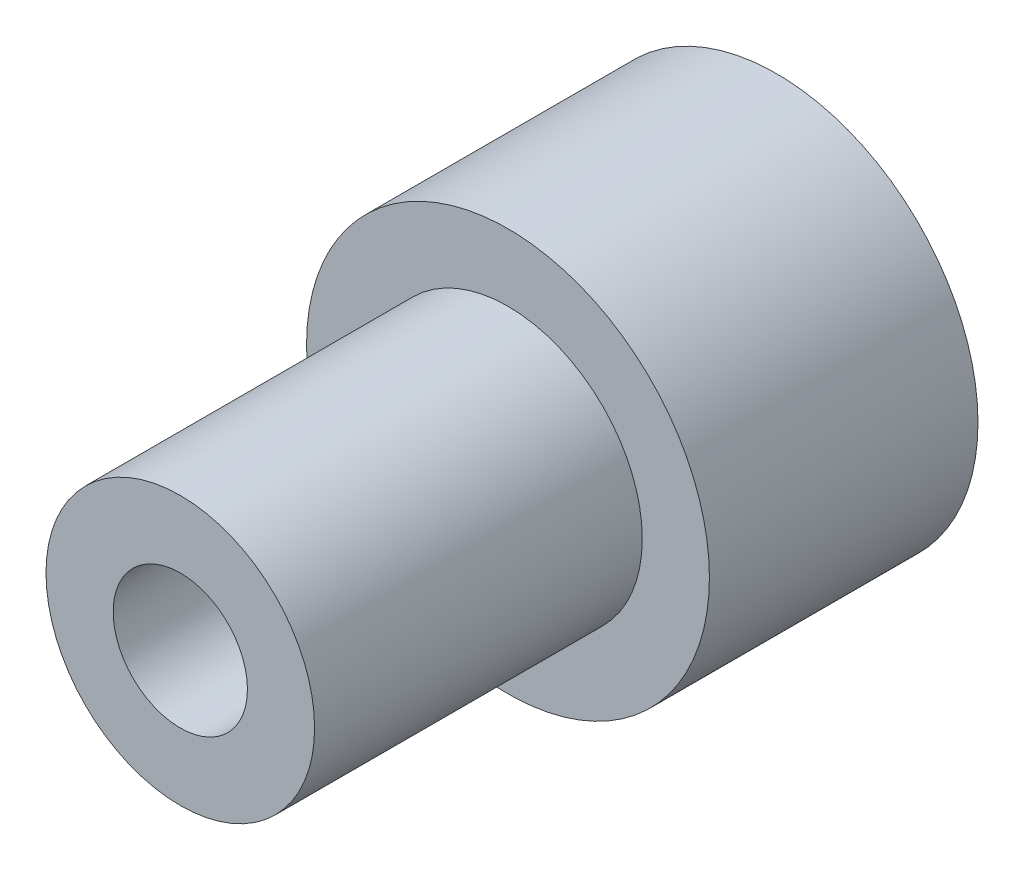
ISO-10303-21;
HEADER;
FILE_DESCRIPTION(('STEP AP214'),'2;1');
FILE_NAME('part.step','',(''),(''),'','','');
FILE_SCHEMA(('AUTOMOTIVE_DESIGN { 1 0 10303 214 1 1 1 1 }'));
ENDSEC;
DATA;
#1=APPLICATION_CONTEXT('core data for automotive mechanical design processes');
#2=APPLICATION_PROTOCOL_DEFINITION('international standard','automotive_design',2000,#1);
#3=PRODUCT_CONTEXT('',#1,'mechanical');
#4=PRODUCT('Part','Part','',(#3));
#5=PRODUCT_RELATED_PRODUCT_CATEGORY('part','',(#4));
#6=PRODUCT_DEFINITION_FORMATION('','',#4);
#7=PRODUCT_DEFINITION_CONTEXT('part definition',#1,'design');
#8=PRODUCT_DEFINITION('design','',#6,#7);
#9=PRODUCT_DEFINITION_SHAPE('','',#8);
#10=(LENGTH_UNIT() NAMED_UNIT(*) SI_UNIT(.MILLI.,.METRE.));
#11=(NAMED_UNIT(*) PLANE_ANGLE_UNIT() SI_UNIT($,.RADIAN.));
#12=(NAMED_UNIT(*) SI_UNIT($,.STERADIAN.) SOLID_ANGLE_UNIT());
#13=UNCERTAINTY_MEASURE_WITH_UNIT(LENGTH_MEASURE(1.E-05),#10,'distance_accuracy_value','');
#14=(GEOMETRIC_REPRESENTATION_CONTEXT(3) GLOBAL_UNCERTAINTY_ASSIGNED_CONTEXT((#13)) GLOBAL_UNIT_ASSIGNED_CONTEXT((#10,
#11,#12)) REPRESENTATION_CONTEXT('',''));
#15=CARTESIAN_POINT('',(0.,0.,0.));
#16=DIRECTION('',(0.,0.,1.));
#17=DIRECTION('',(1.,0.,0.));
#18=AXIS2_PLACEMENT_3D('',#15,#16,#17);
#19=CARTESIAN_POINT('',(0.,0.,0.));
#20=DIRECTION('',(0.,0.,1.));
#21=DIRECTION('',(1.,0.,0.));
#22=AXIS2_PLACEMENT_3D('',#19,#20,#21);
#23=CYLINDRICAL_SURFACE('',#22,1.5875);
#24=CARTESIAN_POINT('',(0.,0.,14.097));
#25=DIRECTION('',(0.,0.,1.));
#26=DIRECTION('',(1.,0.,0.));
#27=AXIS2_PLACEMENT_3D('',#24,#25,#26);
#28=CIRCLE('',#27,1.5875);
#29=CARTESIAN_POINT('',(1.5875,0.,14.097));
#30=VERTEX_POINT('',#29);
#31=EDGE_CURVE('E138',#30,#30,#28,.T.);
#32=ORIENTED_EDGE('',*,*,#31,.T.);
#33=EDGE_LOOP('',(#32));
#34=FACE_BOUND('',#33,.T.);
#35=CARTESIAN_POINT('',(0.,0.,3.683));
#36=DIRECTION('',(0.,0.,-1.));
#37=DIRECTION('',(-1.,0.,0.));
#38=AXIS2_PLACEMENT_3D('',#35,#36,#37);
#39=CIRCLE('',#38,1.5875);
#40=CARTESIAN_POINT('',(-1.5875,0.,3.683));
#41=VERTEX_POINT('',#40);
#42=EDGE_CURVE('E32',#41,#41,#39,.F.);
#43=ORIENTED_EDGE('',*,*,#42,.F.);
#44=EDGE_LOOP('',(#43));
#45=FACE_BOUND('',#44,.T.);
#46=ADVANCED_FACE('F28',(#34,#45),#23,.F.);
#47=CARTESIAN_POINT('',(0.,0.,6.35));
#48=DIRECTION('',(0.,0.,1.));
#49=DIRECTION('',(1.,0.,0.));
#50=AXIS2_PLACEMENT_3D('',#47,#48,#49);
#51=PLANE('',#50);
#52=CARTESIAN_POINT('',(0.,0.,6.35));
#53=DIRECTION('',(0.,0.,1.));
#54=DIRECTION('',(1.,0.,0.));
#55=AXIS2_PLACEMENT_3D('',#52,#53,#54);
#56=CIRCLE('',#55,4.7625);
#57=CARTESIAN_POINT('',(4.7625,0.,6.35));
#58=VERTEX_POINT('',#57);
#59=EDGE_CURVE('E11',#58,#58,#56,.T.);
#60=ORIENTED_EDGE('',*,*,#59,.T.);
#61=EDGE_LOOP('',(#60));
#62=FACE_BOUND('',#61,.T.);
#63=CARTESIAN_POINT('',(0.,0.,6.35));
#64=DIRECTION('',(0.,0.,1.));
#65=DIRECTION('',(1.,0.,0.));
#66=AXIS2_PLACEMENT_3D('',#63,#64,#65);
#67=CIRCLE('',#66,3.175);
#68=CARTESIAN_POINT('',(3.175,0.,6.35));
#69=VERTEX_POINT('',#68);
#70=EDGE_CURVE('E141',#69,#69,#67,.T.);
#71=ORIENTED_EDGE('',*,*,#70,.F.);
#72=EDGE_LOOP('',(#71));
#73=FACE_BOUND('',#72,.T.);
#74=ADVANCED_FACE('F160',(#62,#73),#51,.T.);
#75=CARTESIAN_POINT('',(0.,0.,6.35));
#76=DIRECTION('',(0.,0.,-1.));
#77=DIRECTION('',(-1.,0.,0.));
#78=AXIS2_PLACEMENT_3D('',#75,#76,#77);
#79=CYLINDRICAL_SURFACE('',#78,4.7625);
#80=ORIENTED_EDGE('',*,*,#59,.F.);
#81=EDGE_LOOP('',(#80));
#82=FACE_BOUND('',#81,.T.);
#83=CARTESIAN_POINT('',(0.,0.,0.));
#84=DIRECTION('',(0.,0.,1.));
#85=DIRECTION('',(1.,0.,0.));
#86=AXIS2_PLACEMENT_3D('',#83,#84,#85);
#87=CIRCLE('',#86,4.7625);
#88=CARTESIAN_POINT('',(4.7625,0.,0.));
#89=VERTEX_POINT('',#88);
#90=EDGE_CURVE('E37',#89,#89,#87,.T.);
#91=ORIENTED_EDGE('',*,*,#90,.T.);
#92=EDGE_LOOP('',(#91));
#93=FACE_BOUND('',#92,.T.);
#94=ADVANCED_FACE('F30',(#82,#93),#79,.T.);
#95=CARTESIAN_POINT('',(0.,0.,0.));
#96=DIRECTION('',(0.,0.,1.));
#97=DIRECTION('',(1.,0.,0.));
#98=AXIS2_PLACEMENT_3D('',#95,#96,#97);
#99=PLANE('',#98);
#100=DIRECTION('',(0.866025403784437,-0.500000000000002,0.));
#101=VECTOR('',#100,1.);
#102=CARTESIAN_POINT('',(2.38125,1.3748153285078,0.));
#103=LINE('',#102,#101);
#104=CARTESIAN_POINT('',(0.,2.74963065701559,0.));
#105=VERTEX_POINT('',#104);
#106=CARTESIAN_POINT('',(2.38125,1.3748153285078,0.));
#107=VERTEX_POINT('',#106);
#108=EDGE_CURVE('E98',#105,#107,#103,.T.);
#109=ORIENTED_EDGE('',*,*,#108,.F.);
#110=DIRECTION('',(0.86602540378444,0.499999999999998,0.));
#111=VECTOR('',#110,1.);
#112=CARTESIAN_POINT('',(-2.38125,1.3748153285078,0.));
#113=LINE('',#112,#111);
#114=CARTESIAN_POINT('',(-2.38125,1.3748153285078,0.));
#115=VERTEX_POINT('',#114);
#116=EDGE_CURVE('E44',#115,#105,#113,.T.);
#117=ORIENTED_EDGE('',*,*,#116,.F.);
#118=DIRECTION('',(0.,1.,0.));
#119=VECTOR('',#118,1.);
#120=CARTESIAN_POINT('',(-2.38125,1.3748153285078,0.));
#121=LINE('',#120,#119);
#122=CARTESIAN_POINT('',(-2.38125,-1.3748153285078,0.));
#123=VERTEX_POINT('',#122);
#124=EDGE_CURVE('E114',#123,#115,#121,.T.);
#125=ORIENTED_EDGE('',*,*,#124,.F.);
#126=DIRECTION('',(-0.866025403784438,0.5,0.));
#127=VECTOR('',#126,1.);
#128=CARTESIAN_POINT('',(0.,-2.74963065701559,0.));
#129=LINE('',#128,#127);
#130=CARTESIAN_POINT('',(0.,-2.74963065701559,0.));
#131=VERTEX_POINT('',#130);
#132=EDGE_CURVE('E108',#131,#123,#129,.T.);
#133=ORIENTED_EDGE('',*,*,#132,.F.);
#134=DIRECTION('',(-0.866025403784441,-0.499999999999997,0.));
#135=VECTOR('',#134,1.);
#136=CARTESIAN_POINT('',(2.38125,-1.3748153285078,0.));
#137=LINE('',#136,#135);
#138=CARTESIAN_POINT('',(2.38125,-1.3748153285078,0.));
#139=VERTEX_POINT('',#138);
#140=EDGE_CURVE('E106',#139,#131,#137,.T.);
#141=ORIENTED_EDGE('',*,*,#140,.F.);
#142=DIRECTION('',(0.,-1.,0.));
#143=VECTOR('',#142,1.);
#144=CARTESIAN_POINT('',(2.38125,1.3748153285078,0.));
#145=LINE('',#144,#143);
#146=EDGE_CURVE('E87',#107,#139,#145,.T.);
#147=ORIENTED_EDGE('',*,*,#146,.F.);
#148=EDGE_LOOP('',(#109,#117,#125,#133,#141,#147));
#149=FACE_BOUND('',#148,.T.);
#150=ORIENTED_EDGE('',*,*,#90,.F.);
#151=EDGE_LOOP('',(#150));
#152=FACE_BOUND('',#151,.T.);
#153=ADVANCED_FACE('F102',(#149,#152),#99,.F.);
#154=CARTESIAN_POINT('',(0.,0.,14.097));
#155=DIRECTION('',(0.,0.,-1.));
#156=DIRECTION('',(-1.,0.,0.));
#157=AXIS2_PLACEMENT_3D('',#154,#155,#156);
#158=CYLINDRICAL_SURFACE('',#157,3.175);
#159=CARTESIAN_POINT('',(0.,0.,14.097));
#160=DIRECTION('',(0.,0.,1.));
#161=DIRECTION('',(1.,0.,0.));
#162=AXIS2_PLACEMENT_3D('',#159,#160,#161);
#163=CIRCLE('',#162,3.175);
#164=CARTESIAN_POINT('',(3.175,0.,14.097));
#165=VERTEX_POINT('',#164);
#166=EDGE_CURVE('E144',#165,#165,#163,.T.);
#167=ORIENTED_EDGE('',*,*,#166,.F.);
#168=EDGE_LOOP('',(#167));
#169=FACE_BOUND('',#168,.T.);
#170=ORIENTED_EDGE('',*,*,#70,.T.);
#171=EDGE_LOOP('',(#170));
#172=FACE_BOUND('',#171,.T.);
#173=ADVANCED_FACE('F151',(#169,#172),#158,.T.);
#174=CARTESIAN_POINT('',(0.,0.,14.097));
#175=DIRECTION('',(0.,0.,1.));
#176=DIRECTION('',(1.,0.,0.));
#177=AXIS2_PLACEMENT_3D('',#174,#175,#176);
#178=PLANE('',#177);
#179=ORIENTED_EDGE('',*,*,#31,.F.);
#180=EDGE_LOOP('',(#179));
#181=FACE_BOUND('',#180,.T.);
#182=ORIENTED_EDGE('',*,*,#166,.T.);
#183=EDGE_LOOP('',(#182));
#184=FACE_BOUND('',#183,.T.);
#185=ADVANCED_FACE('F157',(#181,#184),#178,.T.);
#186=CARTESIAN_POINT('',(2.38125,4.12444598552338,3.683));
#187=DIRECTION('',(0.,0.,-1.));
#188=DIRECTION('',(-1.,0.,0.));
#189=AXIS2_PLACEMENT_3D('',#186,#187,#188);
#190=PLANE('',#189);
#191=DIRECTION('',(0.86602540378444,0.499999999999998,0.));
#192=VECTOR('',#191,1.);
#193=CARTESIAN_POINT('',(-2.38125,1.3748153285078,3.683));
#194=LINE('',#193,#192);
#195=CARTESIAN_POINT('',(-2.38125,1.3748153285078,3.683));
#196=VERTEX_POINT('',#195);
#197=CARTESIAN_POINT('',(0.,2.7496306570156,3.683));
#198=VERTEX_POINT('',#197);
#199=EDGE_CURVE('E116',#196,#198,#194,.T.);
#200=ORIENTED_EDGE('',*,*,#199,.T.);
#201=DIRECTION('',(0.866025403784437,-0.500000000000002,0.));
#202=VECTOR('',#201,1.);
#203=CARTESIAN_POINT('',(2.38125,1.3748153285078,3.683));
#204=LINE('',#203,#202);
#205=CARTESIAN_POINT('',(2.38125,1.3748153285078,3.683));
#206=VERTEX_POINT('',#205);
#207=EDGE_CURVE('E119',#198,#206,#204,.T.);
#208=ORIENTED_EDGE('',*,*,#207,.T.);
#209=DIRECTION('',(0.,-1.,0.));
#210=VECTOR('',#209,1.);
#211=CARTESIAN_POINT('',(2.38125,1.3748153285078,3.683));
#212=LINE('',#211,#210);
#213=CARTESIAN_POINT('',(2.38125,-1.3748153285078,3.683));
#214=VERTEX_POINT('',#213);
#215=EDGE_CURVE('E90',#206,#214,#212,.T.);
#216=ORIENTED_EDGE('',*,*,#215,.T.);
#217=DIRECTION('',(-0.866025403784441,-0.499999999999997,0.));
#218=VECTOR('',#217,1.);
#219=CARTESIAN_POINT('',(2.38125,-1.3748153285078,3.683));
#220=LINE('',#219,#218);
#221=CARTESIAN_POINT('',(0.,-2.74963065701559,3.683));
#222=VERTEX_POINT('',#221);
#223=EDGE_CURVE('E122',#214,#222,#220,.T.);
#224=ORIENTED_EDGE('',*,*,#223,.T.);
#225=DIRECTION('',(-0.866025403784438,0.5,0.));
#226=VECTOR('',#225,1.);
#227=CARTESIAN_POINT('',(0.,-2.74963065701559,3.683));
#228=LINE('',#227,#226);
#229=CARTESIAN_POINT('',(-2.38125,-1.3748153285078,3.683));
#230=VERTEX_POINT('',#229);
#231=EDGE_CURVE('E125',#222,#230,#228,.T.);
#232=ORIENTED_EDGE('',*,*,#231,.T.);
#233=DIRECTION('',(0.,1.,0.));
#234=VECTOR('',#233,1.);
#235=CARTESIAN_POINT('',(-2.38125,1.3748153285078,3.683));
#236=LINE('',#235,#234);
#237=EDGE_CURVE('E128',#230,#196,#236,.T.);
#238=ORIENTED_EDGE('',*,*,#237,.T.);
#239=EDGE_LOOP('',(#200,#208,#216,#224,#232,#238));
#240=FACE_BOUND('',#239,.T.);
#241=ORIENTED_EDGE('',*,*,#42,.T.);
#242=EDGE_LOOP('',(#241));
#243=FACE_BOUND('',#242,.T.);
#244=ADVANCED_FACE('F175',(#240,#243),#190,.T.);
#245=CARTESIAN_POINT('',(-2.38125,1.3748153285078,3.683));
#246=DIRECTION('',(-0.499999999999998,0.86602540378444,0.));
#247=DIRECTION('',(-0.86602540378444,-0.499999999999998,0.));
#248=AXIS2_PLACEMENT_3D('',#245,#246,#247);
#249=PLANE('',#248);
#250=ORIENTED_EDGE('',*,*,#116,.T.);
#251=DIRECTION('',(0.,0.,-1.));
#252=VECTOR('',#251,1.);
#253=CARTESIAN_POINT('',(0.,2.7496306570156,3.683));
#254=LINE('',#253,#252);
#255=EDGE_CURVE('E95',#198,#105,#254,.T.);
#256=ORIENTED_EDGE('',*,*,#255,.F.);
#257=ORIENTED_EDGE('',*,*,#199,.F.);
#258=DIRECTION('',(0.,0.,-1.));
#259=VECTOR('',#258,1.);
#260=CARTESIAN_POINT('',(-2.38125,1.3748153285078,3.683));
#261=LINE('',#260,#259);
#262=EDGE_CURVE('E51',#196,#115,#261,.T.);
#263=ORIENTED_EDGE('',*,*,#262,.T.);
#264=EDGE_LOOP('',(#250,#256,#257,#263));
#265=FACE_BOUND('',#264,.T.);
#266=ADVANCED_FACE('F172',(#265),#249,.F.);
#267=CARTESIAN_POINT('',(-2.38125,1.3748153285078,3.683));
#268=DIRECTION('',(-1.,0.,0.));
#269=DIRECTION('',(0.,-1.,0.));
#270=AXIS2_PLACEMENT_3D('',#267,#268,#269);
#271=PLANE('',#270);
#272=ORIENTED_EDGE('',*,*,#124,.T.);
#273=ORIENTED_EDGE('',*,*,#262,.F.);
#274=ORIENTED_EDGE('',*,*,#237,.F.);
#275=DIRECTION('',(0.,0.,-1.));
#276=VECTOR('',#275,1.);
#277=CARTESIAN_POINT('',(-2.38125,-1.3748153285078,3.683));
#278=LINE('',#277,#276);
#279=EDGE_CURVE('E132',#230,#123,#278,.T.);
#280=ORIENTED_EDGE('',*,*,#279,.T.);
#281=EDGE_LOOP('',(#272,#273,#274,#280));
#282=FACE_BOUND('',#281,.T.);
#283=ADVANCED_FACE('F191',(#282),#271,.F.);
#284=CARTESIAN_POINT('',(0.,-2.74963065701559,3.683));
#285=DIRECTION('',(-0.5,-0.866025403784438,0.));
#286=DIRECTION('',(0.866025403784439,-0.5,0.));
#287=AXIS2_PLACEMENT_3D('',#284,#285,#286);
#288=PLANE('',#287);
#289=ORIENTED_EDGE('',*,*,#132,.T.);
#290=ORIENTED_EDGE('',*,*,#279,.F.);
#291=ORIENTED_EDGE('',*,*,#231,.F.);
#292=DIRECTION('',(0.,0.,-1.));
#293=VECTOR('',#292,1.);
#294=CARTESIAN_POINT('',(0.,-2.74963065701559,3.683));
#295=LINE('',#294,#293);
#296=EDGE_CURVE('E134',#222,#131,#295,.T.);
#297=ORIENTED_EDGE('',*,*,#296,.T.);
#298=EDGE_LOOP('',(#289,#290,#291,#297));
#299=FACE_BOUND('',#298,.T.);
#300=ADVANCED_FACE('F196',(#299),#288,.F.);
#301=CARTESIAN_POINT('',(2.38125,-1.3748153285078,3.683));
#302=DIRECTION('',(0.499999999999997,-0.866025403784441,0.));
#303=DIRECTION('',(0.866025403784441,0.499999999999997,0.));
#304=AXIS2_PLACEMENT_3D('',#301,#302,#303);
#305=PLANE('',#304);
#306=ORIENTED_EDGE('',*,*,#140,.T.);
#307=ORIENTED_EDGE('',*,*,#296,.F.);
#308=ORIENTED_EDGE('',*,*,#223,.F.);
#309=DIRECTION('',(0.,0.,-1.));
#310=VECTOR('',#309,1.);
#311=CARTESIAN_POINT('',(2.38125,-1.3748153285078,3.683));
#312=LINE('',#311,#310);
#313=EDGE_CURVE('E94',#214,#139,#312,.T.);
#314=ORIENTED_EDGE('',*,*,#313,.T.);
#315=EDGE_LOOP('',(#306,#307,#308,#314));
#316=FACE_BOUND('',#315,.T.);
#317=ADVANCED_FACE('F199',(#316),#305,.F.);
#318=CARTESIAN_POINT('',(2.38125,1.3748153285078,3.683));
#319=DIRECTION('',(1.,0.,0.));
#320=DIRECTION('',(0.,1.,0.));
#321=AXIS2_PLACEMENT_3D('',#318,#319,#320);
#322=PLANE('',#321);
#323=ORIENTED_EDGE('',*,*,#146,.T.);
#324=ORIENTED_EDGE('',*,*,#313,.F.);
#325=ORIENTED_EDGE('',*,*,#215,.F.);
#326=DIRECTION('',(0.,0.,-1.));
#327=VECTOR('',#326,1.);
#328=CARTESIAN_POINT('',(2.38125,1.3748153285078,3.683));
#329=LINE('',#328,#327);
#330=EDGE_CURVE('E83',#206,#107,#329,.T.);
#331=ORIENTED_EDGE('',*,*,#330,.T.);
#332=EDGE_LOOP('',(#323,#324,#325,#331));
#333=FACE_BOUND('',#332,.T.);
#334=ADVANCED_FACE('F85',(#333),#322,.F.);
#335=CARTESIAN_POINT('',(2.38125,1.3748153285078,3.683));
#336=DIRECTION('',(0.500000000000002,0.866025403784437,0.));
#337=DIRECTION('',(-0.866025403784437,0.500000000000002,0.));
#338=AXIS2_PLACEMENT_3D('',#335,#336,#337);
#339=PLANE('',#338);
#340=ORIENTED_EDGE('',*,*,#108,.T.);
#341=ORIENTED_EDGE('',*,*,#330,.F.);
#342=ORIENTED_EDGE('',*,*,#207,.F.);
#343=ORIENTED_EDGE('',*,*,#255,.T.);
#344=EDGE_LOOP('',(#340,#341,#342,#343));
#345=FACE_BOUND('',#344,.T.);
#346=ADVANCED_FACE('F99',(#345),#339,.F.);
#347=CLOSED_SHELL('',(#46,#74,#94,#153,#173,#185,#244,#266,#283,#300,#317,#334,#346));
#348=MANIFOLD_SOLID_BREP('B2',#347);
#349=ADVANCED_BREP_SHAPE_REPRESENTATION('',(#18,#348),#14);
#350=SHAPE_DEFINITION_REPRESENTATION(#9,#349);
ENDSEC;
END-ISO-10303-21;
